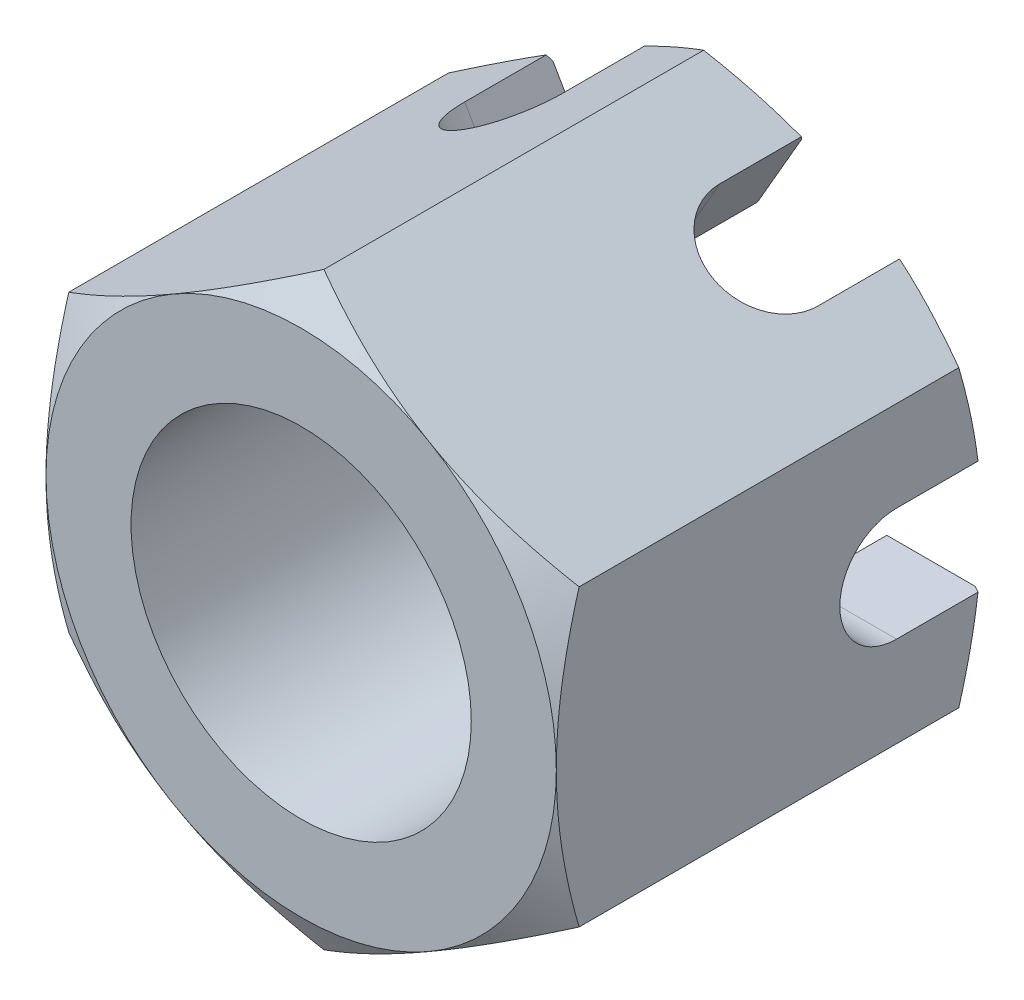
from build123d import *

# Parameters (mm, degrees)
BASE_EXTRUSION_DEPTH         = 15
ESQUISSE3_R                  = 6
ENL_V_MAT_EXTRU_1_DEPTH      = 21.346989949
ENL_V_MAT_EXTRU_2_DEPTH      = 26.632011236
R_P_TITION_CIRCULAIRE1_COUNT = 3


with BuildPart() as part:
    # Esquisse1 → Base-Extrusion (new body)
    with BuildSketch(Plane.XY):
        Polygon((9, -5.196152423), (9, 5.196152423), (0, 10.392304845), (-9, 5.196152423), (-9, -5.196152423), (0, -10.392304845), align=None)
    extrude(amount=-BASE_EXTRUSION_DEPTH)

    # Esquisse2 → Enl_vement de mati_re-R_volution1 (revolve, cut)
    with BuildSketch(Plane(origin=(0, 0, 0), x_dir=(1, 0, 0), z_dir=(0, 1, 0))):
        Polygon((-9, 0), (-22.990381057, 0), (-22.990381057, 15), (-9, 15), (-21.990381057, 7.5), align=None)
    revolve(axis=Axis((0, 0, -15), (0, 0, 1)), mode=Mode.SUBTRACT)

    # Esquisse3 → Enl_v. mat.-Extru.1 (cut, through all)
    with BuildSketch(Plane.XY):
        Circle(ESQUISSE3_R)
    extrude(amount=-ENL_V_MAT_EXTRU_1_DEPTH, mode=Mode.SUBTRACT)

    # Esquisse4 → Enl_v. mat.-Extru.2 (cut, through all)
    with BuildSketch(Plane(origin=(9, 0, 0), x_dir=(0, 0, -1), z_dir=(1, 0, 0))):
        with BuildLine():
            Line((12, 2), (15, 2))
            Line((15, 2), (15, -2))
            Line((15, -2), (12, -2))
            ThreePointArc((12, -2), (10, 0), (12, 2))
        make_face()
    enl_v_mat_extru_2 = extrude(amount=-ENL_V_MAT_EXTRU_2_DEPTH, mode=Mode.SUBTRACT)

    # R_p_tition circulaire1: Enl_v. mat.-Extru.2 ×3 about axis
    r_p_tition_circulaire1_axis = Axis((0, 0, 0), (0, 0, 1))
    for i in range(1, R_P_TITION_CIRCULAIRE1_COUNT):
        add(enl_v_mat_extru_2.rotate(r_p_tition_circulaire1_axis, i * 360 / R_P_TITION_CIRCULAIRE1_COUNT), mode=Mode.SUBTRACT)


solid = part.part
